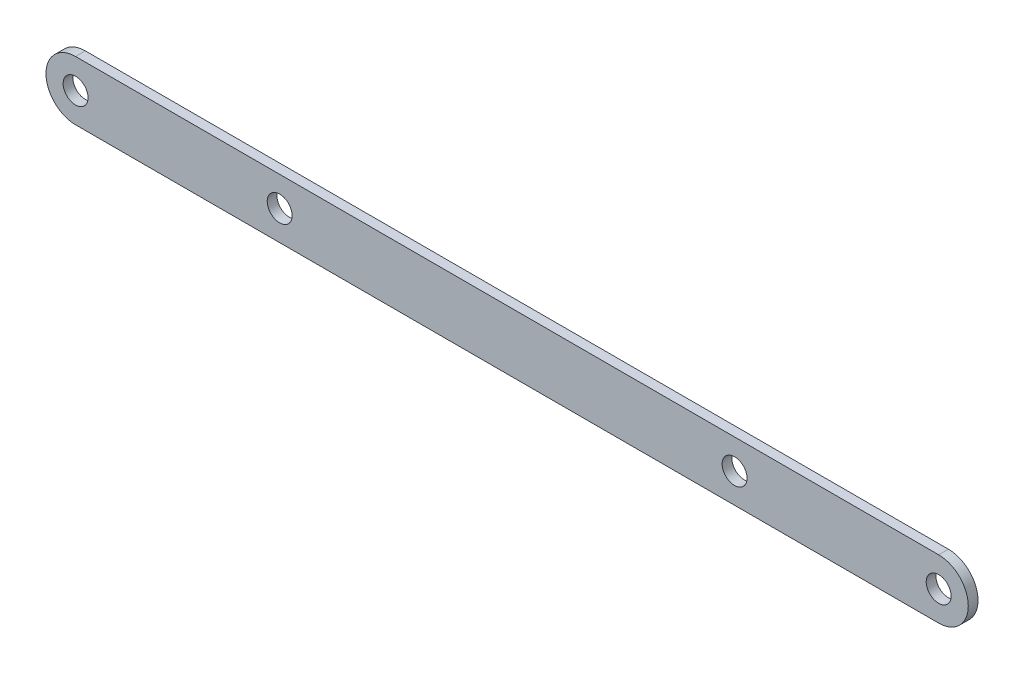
ISO-10303-21;
HEADER;
FILE_DESCRIPTION(('STEP AP214'),'2;1');
FILE_NAME('part.step','',(''),(''),'','','');
FILE_SCHEMA(('AUTOMOTIVE_DESIGN { 1 0 10303 214 1 1 1 1 }'));
ENDSEC;
DATA;
#1=APPLICATION_CONTEXT('core data for automotive mechanical design processes');
#2=APPLICATION_PROTOCOL_DEFINITION('international standard','automotive_design',2000,#1);
#3=PRODUCT_CONTEXT('',#1,'mechanical');
#4=PRODUCT('Part','Part','',(#3));
#5=PRODUCT_RELATED_PRODUCT_CATEGORY('part','',(#4));
#6=PRODUCT_DEFINITION_FORMATION('','',#4);
#7=PRODUCT_DEFINITION_CONTEXT('part definition',#1,'design');
#8=PRODUCT_DEFINITION('design','',#6,#7);
#9=PRODUCT_DEFINITION_SHAPE('','',#8);
#10=(LENGTH_UNIT() NAMED_UNIT(*) SI_UNIT(.MILLI.,.METRE.));
#11=(NAMED_UNIT(*) PLANE_ANGLE_UNIT() SI_UNIT($,.RADIAN.));
#12=(NAMED_UNIT(*) SI_UNIT($,.STERADIAN.) SOLID_ANGLE_UNIT());
#13=UNCERTAINTY_MEASURE_WITH_UNIT(LENGTH_MEASURE(1.E-05),#10,'distance_accuracy_value','');
#14=(GEOMETRIC_REPRESENTATION_CONTEXT(3) GLOBAL_UNCERTAINTY_ASSIGNED_CONTEXT((#13)) GLOBAL_UNIT_ASSIGNED_CONTEXT((#10,
#11,#12)) REPRESENTATION_CONTEXT('',''));
#15=CARTESIAN_POINT('',(0.,0.,0.));
#16=DIRECTION('',(0.,0.,1.));
#17=DIRECTION('',(1.,0.,0.));
#18=AXIS2_PLACEMENT_3D('',#15,#16,#17);
#19=CARTESIAN_POINT('',(-148.38,-12.7,1.5875));
#20=DIRECTION('',(0.,0.,1.));
#21=DIRECTION('',(1.,0.,0.));
#22=AXIS2_PLACEMENT_3D('',#19,#20,#21);
#23=PLANE('',#22);
#24=CARTESIAN_POINT('',(-40.905,-12.7,1.5875));
#25=DIRECTION('',(0.,0.,1.));
#26=DIRECTION('',(1.,0.,0.));
#27=AXIS2_PLACEMENT_3D('',#24,#25,#26);
#28=CIRCLE('',#27,2.032);
#29=CARTESIAN_POINT('',(-38.873,-12.7,1.5875));
#30=VERTEX_POINT('',#29);
#31=EDGE_CURVE('E121',#30,#30,#28,.T.);
#32=ORIENTED_EDGE('',*,*,#31,.F.);
#33=EDGE_LOOP('',(#32));
#34=FACE_BOUND('',#33,.T.);
#35=CARTESIAN_POINT('',(-148.38,-12.7,1.5875));
#36=DIRECTION('',(0.,0.,1.));
#37=DIRECTION('',(1.,0.,0.));
#38=AXIS2_PLACEMENT_3D('',#35,#36,#37);
#39=CIRCLE('',#38,2.03199999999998);
#40=CARTESIAN_POINT('',(-146.348,-12.7,1.5875));
#41=VERTEX_POINT('',#40);
#42=EDGE_CURVE('E100',#41,#41,#39,.T.);
#43=ORIENTED_EDGE('',*,*,#42,.F.);
#44=EDGE_LOOP('',(#43));
#45=FACE_BOUND('',#44,.T.);
#46=CARTESIAN_POINT('',(-148.38,-12.7,1.5875));
#47=DIRECTION('',(0.,0.,1.));
#48=DIRECTION('',(1.,0.,0.));
#49=AXIS2_PLACEMENT_3D('',#46,#47,#48);
#50=CIRCLE('',#49,4.826);
#51=CARTESIAN_POINT('',(-148.38,-7.87399999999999,1.5875));
#52=VERTEX_POINT('',#51);
#53=CARTESIAN_POINT('',(-148.38,-17.526,1.5875));
#54=VERTEX_POINT('',#53);
#55=EDGE_CURVE('E85',#52,#54,#50,.T.);
#56=ORIENTED_EDGE('',*,*,#55,.T.);
#57=DIRECTION('',(1.,0.,0.));
#58=VECTOR('',#57,1.);
#59=CARTESIAN_POINT('',(-148.38,-17.526,1.5875));
#60=LINE('',#59,#58);
#61=CARTESIAN_POINT('',(-7.62,-17.526,1.5875));
#62=VERTEX_POINT('',#61);
#63=EDGE_CURVE('E80',#54,#62,#60,.T.);
#64=ORIENTED_EDGE('',*,*,#63,.T.);
#65=CARTESIAN_POINT('',(-7.62000000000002,-12.7,1.5875));
#66=DIRECTION('',(0.,0.,1.));
#67=DIRECTION('',(1.,0.,0.));
#68=AXIS2_PLACEMENT_3D('',#65,#66,#67);
#69=CIRCLE('',#68,4.826);
#70=CARTESIAN_POINT('',(-7.62,-7.87399999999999,1.5875));
#71=VERTEX_POINT('',#70);
#72=EDGE_CURVE('E83',#62,#71,#69,.T.);
#73=ORIENTED_EDGE('',*,*,#72,.T.);
#74=DIRECTION('',(-1.,0.,0.));
#75=VECTOR('',#74,1.);
#76=CARTESIAN_POINT('',(-148.38,-7.87399999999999,1.5875));
#77=LINE('',#76,#75);
#78=EDGE_CURVE('E50',#71,#52,#77,.T.);
#79=ORIENTED_EDGE('',*,*,#78,.T.);
#80=EDGE_LOOP('',(#56,#64,#73,#79));
#81=FACE_BOUND('',#80,.T.);
#82=CARTESIAN_POINT('',(-115.095,-12.7,1.5875));
#83=DIRECTION('',(0.,0.,1.));
#84=DIRECTION('',(1.,0.,0.));
#85=AXIS2_PLACEMENT_3D('',#82,#83,#84);
#86=CIRCLE('',#85,2.03200000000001);
#87=CARTESIAN_POINT('',(-113.063,-12.7,1.5875));
#88=VERTEX_POINT('',#87);
#89=EDGE_CURVE('E115',#88,#88,#86,.T.);
#90=ORIENTED_EDGE('',*,*,#89,.F.);
#91=EDGE_LOOP('',(#90));
#92=FACE_BOUND('',#91,.T.);
#93=CARTESIAN_POINT('',(-7.62000000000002,-12.7,1.5875));
#94=DIRECTION('',(0.,0.,1.));
#95=DIRECTION('',(1.,0.,0.));
#96=AXIS2_PLACEMENT_3D('',#93,#94,#95);
#97=CIRCLE('',#96,2.03200000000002);
#98=CARTESIAN_POINT('',(-5.588,-12.7,1.5875));
#99=VERTEX_POINT('',#98);
#100=EDGE_CURVE('E127',#99,#99,#97,.T.);
#101=ORIENTED_EDGE('',*,*,#100,.F.);
#102=EDGE_LOOP('',(#101));
#103=FACE_BOUND('',#102,.T.);
#104=ADVANCED_FACE('F33',(#34,#45,#81,#92,#103),#23,.T.);
#105=CARTESIAN_POINT('',(-148.38,-12.7,0.));
#106=DIRECTION('',(0.,0.,1.));
#107=DIRECTION('',(1.,0.,0.));
#108=AXIS2_PLACEMENT_3D('',#105,#106,#107);
#109=PLANE('',#108);
#110=CARTESIAN_POINT('',(-40.905,-12.7,0.));
#111=DIRECTION('',(0.,0.,1.));
#112=DIRECTION('',(1.,0.,0.));
#113=AXIS2_PLACEMENT_3D('',#110,#111,#112);
#114=CIRCLE('',#113,2.032);
#115=CARTESIAN_POINT('',(-38.873,-12.7,0.));
#116=VERTEX_POINT('',#115);
#117=EDGE_CURVE('E124',#116,#116,#114,.T.);
#118=ORIENTED_EDGE('',*,*,#117,.T.);
#119=EDGE_LOOP('',(#118));
#120=FACE_BOUND('',#119,.T.);
#121=CARTESIAN_POINT('',(-148.38,-12.7,0.));
#122=DIRECTION('',(0.,0.,1.));
#123=DIRECTION('',(1.,0.,0.));
#124=AXIS2_PLACEMENT_3D('',#121,#122,#123);
#125=CIRCLE('',#124,2.03199999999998);
#126=CARTESIAN_POINT('',(-146.348,-12.7,0.));
#127=VERTEX_POINT('',#126);
#128=EDGE_CURVE('E112',#127,#127,#125,.T.);
#129=ORIENTED_EDGE('',*,*,#128,.T.);
#130=EDGE_LOOP('',(#129));
#131=FACE_BOUND('',#130,.T.);
#132=CARTESIAN_POINT('',(-148.38,-12.7,0.));
#133=DIRECTION('',(0.,0.,1.));
#134=DIRECTION('',(1.,0.,0.));
#135=AXIS2_PLACEMENT_3D('',#132,#133,#134);
#136=CIRCLE('',#135,4.826);
#137=CARTESIAN_POINT('',(-148.38,-7.87399999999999,0.));
#138=VERTEX_POINT('',#137);
#139=CARTESIAN_POINT('',(-148.38,-17.526,0.));
#140=VERTEX_POINT('',#139);
#141=EDGE_CURVE('E97',#138,#140,#136,.T.);
#142=ORIENTED_EDGE('',*,*,#141,.F.);
#143=DIRECTION('',(-1.,0.,0.));
#144=VECTOR('',#143,1.);
#145=CARTESIAN_POINT('',(-148.38,-7.87399999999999,0.));
#146=LINE('',#145,#144);
#147=CARTESIAN_POINT('',(-7.62,-7.87399999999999,0.));
#148=VERTEX_POINT('',#147);
#149=EDGE_CURVE('E73',#148,#138,#146,.T.);
#150=ORIENTED_EDGE('',*,*,#149,.F.);
#151=CARTESIAN_POINT('',(-7.62000000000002,-12.7,0.));
#152=DIRECTION('',(0.,0.,1.));
#153=DIRECTION('',(1.,0.,0.));
#154=AXIS2_PLACEMENT_3D('',#151,#152,#153);
#155=CIRCLE('',#154,4.826);
#156=CARTESIAN_POINT('',(-7.62,-17.526,0.));
#157=VERTEX_POINT('',#156);
#158=EDGE_CURVE('E67',#157,#148,#155,.T.);
#159=ORIENTED_EDGE('',*,*,#158,.F.);
#160=DIRECTION('',(1.,0.,0.));
#161=VECTOR('',#160,1.);
#162=CARTESIAN_POINT('',(-148.38,-17.526,0.));
#163=LINE('',#162,#161);
#164=EDGE_CURVE('E89',#140,#157,#163,.T.);
#165=ORIENTED_EDGE('',*,*,#164,.F.);
#166=EDGE_LOOP('',(#142,#150,#159,#165));
#167=FACE_BOUND('',#166,.T.);
#168=CARTESIAN_POINT('',(-115.095,-12.7,0.));
#169=DIRECTION('',(0.,0.,1.));
#170=DIRECTION('',(1.,0.,0.));
#171=AXIS2_PLACEMENT_3D('',#168,#169,#170);
#172=CIRCLE('',#171,2.03200000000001);
#173=CARTESIAN_POINT('',(-113.063,-12.7,0.));
#174=VERTEX_POINT('',#173);
#175=EDGE_CURVE('E118',#174,#174,#172,.T.);
#176=ORIENTED_EDGE('',*,*,#175,.T.);
#177=EDGE_LOOP('',(#176));
#178=FACE_BOUND('',#177,.T.);
#179=CARTESIAN_POINT('',(-7.62000000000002,-12.7,0.));
#180=DIRECTION('',(0.,0.,1.));
#181=DIRECTION('',(1.,0.,0.));
#182=AXIS2_PLACEMENT_3D('',#179,#180,#181);
#183=CIRCLE('',#182,2.03200000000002);
#184=CARTESIAN_POINT('',(-5.588,-12.7,0.));
#185=VERTEX_POINT('',#184);
#186=EDGE_CURVE('E130',#185,#185,#183,.T.);
#187=ORIENTED_EDGE('',*,*,#186,.T.);
#188=EDGE_LOOP('',(#187));
#189=FACE_BOUND('',#188,.T.);
#190=ADVANCED_FACE('F108',(#120,#131,#167,#178,#189),#109,.F.);
#191=CARTESIAN_POINT('',(-148.38,-12.7,1.5875));
#192=DIRECTION('',(0.,0.,-1.));
#193=DIRECTION('',(-1.,0.,0.));
#194=AXIS2_PLACEMENT_3D('',#191,#192,#193);
#195=CYLINDRICAL_SURFACE('',#194,4.826);
#196=ORIENTED_EDGE('',*,*,#141,.T.);
#197=DIRECTION('',(0.,0.,-1.));
#198=VECTOR('',#197,1.);
#199=CARTESIAN_POINT('',(-148.38,-17.526,1.5875));
#200=LINE('',#199,#198);
#201=EDGE_CURVE('E11',#54,#140,#200,.T.);
#202=ORIENTED_EDGE('',*,*,#201,.F.);
#203=ORIENTED_EDGE('',*,*,#55,.F.);
#204=DIRECTION('',(0.,0.,-1.));
#205=VECTOR('',#204,1.);
#206=CARTESIAN_POINT('',(-148.38,-7.87399999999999,1.5875));
#207=LINE('',#206,#205);
#208=EDGE_CURVE('E93',#52,#138,#207,.T.);
#209=ORIENTED_EDGE('',*,*,#208,.T.);
#210=EDGE_LOOP('',(#196,#202,#203,#209));
#211=FACE_BOUND('',#210,.T.);
#212=ADVANCED_FACE('F35',(#211),#195,.T.);
#213=CARTESIAN_POINT('',(-148.38,-17.526,1.5875));
#214=DIRECTION('',(0.,1.,0.));
#215=DIRECTION('',(-1.,0.,0.));
#216=AXIS2_PLACEMENT_3D('',#213,#214,#215);
#217=PLANE('',#216);
#218=ORIENTED_EDGE('',*,*,#164,.T.);
#219=DIRECTION('',(0.,0.,-1.));
#220=VECTOR('',#219,1.);
#221=CARTESIAN_POINT('',(-7.62,-17.526,1.5875));
#222=LINE('',#221,#220);
#223=EDGE_CURVE('E42',#62,#157,#222,.T.);
#224=ORIENTED_EDGE('',*,*,#223,.F.);
#225=ORIENTED_EDGE('',*,*,#63,.F.);
#226=ORIENTED_EDGE('',*,*,#201,.T.);
#227=EDGE_LOOP('',(#218,#224,#225,#226));
#228=FACE_BOUND('',#227,.T.);
#229=ADVANCED_FACE('F88',(#228),#217,.F.);
#230=CARTESIAN_POINT('',(-7.62000000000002,-12.7,1.5875));
#231=DIRECTION('',(0.,0.,-1.));
#232=DIRECTION('',(-1.,0.,0.));
#233=AXIS2_PLACEMENT_3D('',#230,#231,#232);
#234=CYLINDRICAL_SURFACE('',#233,4.826);
#235=ORIENTED_EDGE('',*,*,#158,.T.);
#236=DIRECTION('',(0.,0.,-1.));
#237=VECTOR('',#236,1.);
#238=CARTESIAN_POINT('',(-7.62,-7.87399999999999,1.5875));
#239=LINE('',#238,#237);
#240=EDGE_CURVE('E90',#71,#148,#239,.T.);
#241=ORIENTED_EDGE('',*,*,#240,.F.);
#242=ORIENTED_EDGE('',*,*,#72,.F.);
#243=ORIENTED_EDGE('',*,*,#223,.T.);
#244=EDGE_LOOP('',(#235,#241,#242,#243));
#245=FACE_BOUND('',#244,.T.);
#246=ADVANCED_FACE('F91',(#245),#234,.T.);
#247=CARTESIAN_POINT('',(-148.38,-7.87399999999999,1.5875));
#248=DIRECTION('',(0.,-1.,0.));
#249=DIRECTION('',(1.,0.,0.));
#250=AXIS2_PLACEMENT_3D('',#247,#248,#249);
#251=PLANE('',#250);
#252=ORIENTED_EDGE('',*,*,#149,.T.);
#253=ORIENTED_EDGE('',*,*,#208,.F.);
#254=ORIENTED_EDGE('',*,*,#78,.F.);
#255=ORIENTED_EDGE('',*,*,#240,.T.);
#256=EDGE_LOOP('',(#252,#253,#254,#255));
#257=FACE_BOUND('',#256,.T.);
#258=ADVANCED_FACE('F105',(#257),#251,.F.);
#259=CARTESIAN_POINT('',(-148.38,-12.7,1.5875));
#260=DIRECTION('',(0.,0.,-1.));
#261=DIRECTION('',(-1.,0.,0.));
#262=AXIS2_PLACEMENT_3D('',#259,#260,#261);
#263=CYLINDRICAL_SURFACE('',#262,2.03199999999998);
#264=ORIENTED_EDGE('',*,*,#42,.T.);
#265=EDGE_LOOP('',(#264));
#266=FACE_BOUND('',#265,.T.);
#267=ORIENTED_EDGE('',*,*,#128,.F.);
#268=EDGE_LOOP('',(#267));
#269=FACE_BOUND('',#268,.T.);
#270=ADVANCED_FACE('F150',(#266,#269),#263,.F.);
#271=CARTESIAN_POINT('',(-115.095,-12.7,1.5875));
#272=DIRECTION('',(0.,0.,-1.));
#273=DIRECTION('',(-1.,0.,0.));
#274=AXIS2_PLACEMENT_3D('',#271,#272,#273);
#275=CYLINDRICAL_SURFACE('',#274,2.03200000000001);
#276=ORIENTED_EDGE('',*,*,#89,.T.);
#277=EDGE_LOOP('',(#276));
#278=FACE_BOUND('',#277,.T.);
#279=ORIENTED_EDGE('',*,*,#175,.F.);
#280=EDGE_LOOP('',(#279));
#281=FACE_BOUND('',#280,.T.);
#282=ADVANCED_FACE('F196',(#278,#281),#275,.F.);
#283=CARTESIAN_POINT('',(-40.905,-12.7,1.5875));
#284=DIRECTION('',(0.,0.,-1.));
#285=DIRECTION('',(-1.,0.,0.));
#286=AXIS2_PLACEMENT_3D('',#283,#284,#285);
#287=CYLINDRICAL_SURFACE('',#286,2.032);
#288=ORIENTED_EDGE('',*,*,#31,.T.);
#289=EDGE_LOOP('',(#288));
#290=FACE_BOUND('',#289,.T.);
#291=ORIENTED_EDGE('',*,*,#117,.F.);
#292=EDGE_LOOP('',(#291));
#293=FACE_BOUND('',#292,.T.);
#294=ADVANCED_FACE('F204',(#290,#293),#287,.F.);
#295=CARTESIAN_POINT('',(-7.62000000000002,-12.7,1.5875));
#296=DIRECTION('',(0.,0.,-1.));
#297=DIRECTION('',(-1.,0.,0.));
#298=AXIS2_PLACEMENT_3D('',#295,#296,#297);
#299=CYLINDRICAL_SURFACE('',#298,2.03200000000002);
#300=ORIENTED_EDGE('',*,*,#100,.T.);
#301=EDGE_LOOP('',(#300));
#302=FACE_BOUND('',#301,.T.);
#303=ORIENTED_EDGE('',*,*,#186,.F.);
#304=EDGE_LOOP('',(#303));
#305=FACE_BOUND('',#304,.T.);
#306=ADVANCED_FACE('F136',(#302,#305),#299,.F.);
#307=CLOSED_SHELL('',(#104,#190,#212,#229,#246,#258,#270,#282,#294,#306));
#308=MANIFOLD_SOLID_BREP('B2',#307);
#309=ADVANCED_BREP_SHAPE_REPRESENTATION('',(#18,#308),#14);
#310=SHAPE_DEFINITION_REPRESENTATION(#9,#309);
ENDSEC;
END-ISO-10303-21;
